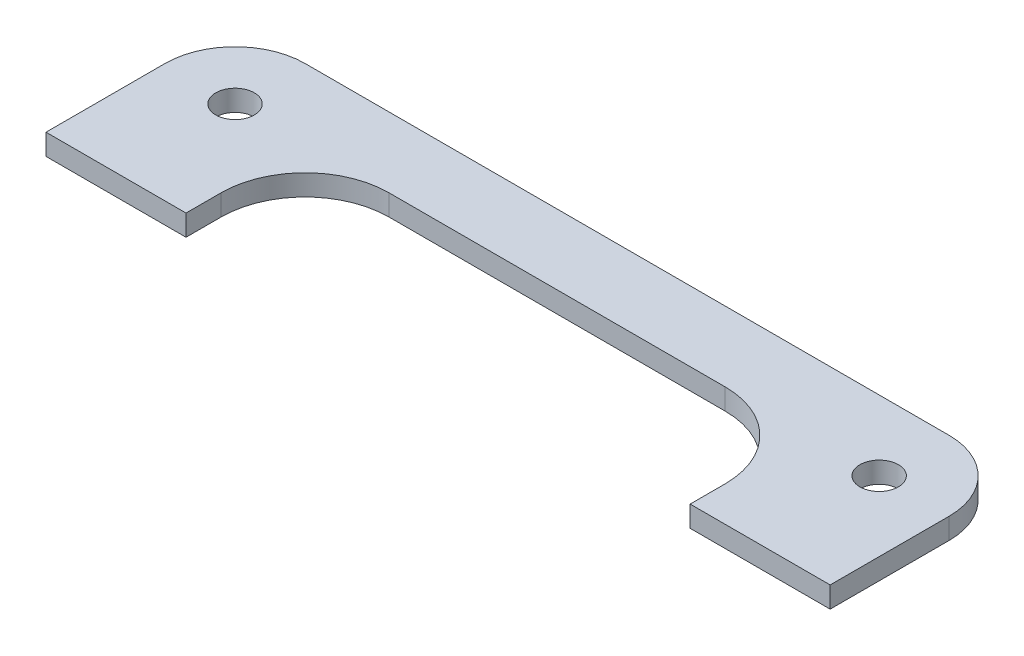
from build123d import *

# Parameters (mm, degrees)
SKETCH1_R      = 2.75
EXTRUDE1_DEPTH = 3


with BuildPart() as part:
    # Sketch1 → Extrude1 (new body)
    with BuildSketch(Plane(origin=(0, 0, 0), x_dir=(1, 0, 0), z_dir=(0, 1, 0))):
        with BuildLine():
            Line((0, 0), (0, 17))
            ThreePointArc((0, 17), (2.928932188, 24.071067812), (10, 27))
            Line((10, 27), (102, 27))
            ThreePointArc((102, 27), (109.071067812, 24.071067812), (112, 17))
            Line((112, 17), (112, 0))
            Line((112, 0), (92, 0))
            Line((92, 0), (92, 5))
            ThreePointArc((92, 5), (88.485281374, 13.485281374), (80, 17))
            Line((80, 17), (32, 17))
            ThreePointArc((32, 17), (23.514718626, 13.485281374), (20, 5))
            Line((20, 5), (20, 0))
            Line((20, 0), (0, 0))
        make_face()
        with Locations(Location((10, 17, 0), (0, 0, 270))):
            Circle(SKETCH1_R, mode=Mode.SUBTRACT)
        with Locations(Location((102, 17, 0), (0, 0, 270))):
            Circle(SKETCH1_R, mode=Mode.SUBTRACT)
    extrude(amount=EXTRUDE1_DEPTH)


solid = part.part
